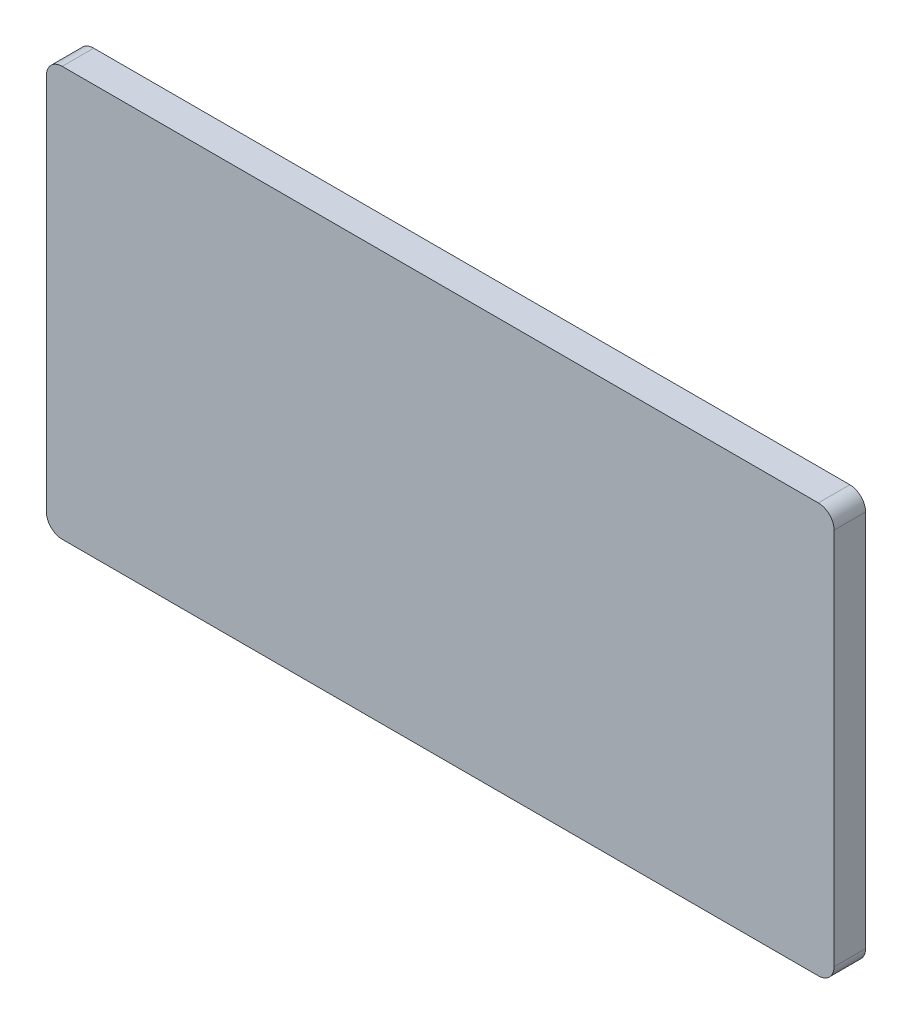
ISO-10303-21;
HEADER;
FILE_DESCRIPTION(('STEP AP214'),'2;1');
FILE_NAME('part.step','',(''),(''),'','','');
FILE_SCHEMA(('AUTOMOTIVE_DESIGN { 1 0 10303 214 1 1 1 1 }'));
ENDSEC;
DATA;
#1=APPLICATION_CONTEXT('core data for automotive mechanical design processes');
#2=APPLICATION_PROTOCOL_DEFINITION('international standard','automotive_design',2000,#1);
#3=PRODUCT_CONTEXT('',#1,'mechanical');
#4=PRODUCT('Part','Part','',(#3));
#5=PRODUCT_RELATED_PRODUCT_CATEGORY('part','',(#4));
#6=PRODUCT_DEFINITION_FORMATION('','',#4);
#7=PRODUCT_DEFINITION_CONTEXT('part definition',#1,'design');
#8=PRODUCT_DEFINITION('design','',#6,#7);
#9=PRODUCT_DEFINITION_SHAPE('','',#8);
#10=(LENGTH_UNIT() NAMED_UNIT(*) SI_UNIT(.MILLI.,.METRE.));
#11=(NAMED_UNIT(*) PLANE_ANGLE_UNIT() SI_UNIT($,.RADIAN.));
#12=(NAMED_UNIT(*) SI_UNIT($,.STERADIAN.) SOLID_ANGLE_UNIT());
#13=UNCERTAINTY_MEASURE_WITH_UNIT(LENGTH_MEASURE(1.E-05),#10,'distance_accuracy_value','');
#14=(GEOMETRIC_REPRESENTATION_CONTEXT(3) GLOBAL_UNCERTAINTY_ASSIGNED_CONTEXT((#13)) GLOBAL_UNIT_ASSIGNED_CONTEXT((#10,
#11,#12)) REPRESENTATION_CONTEXT('',''));
#15=CARTESIAN_POINT('',(0.,0.,0.));
#16=DIRECTION('',(0.,0.,1.));
#17=DIRECTION('',(1.,0.,0.));
#18=AXIS2_PLACEMENT_3D('',#15,#16,#17);
#19=CARTESIAN_POINT('',(-25.,13.,2.));
#20=DIRECTION('',(1.,0.,0.));
#21=DIRECTION('',(0.,1.,0.));
#22=AXIS2_PLACEMENT_3D('',#19,#20,#21);
#23=PLANE('',#22);
#24=DIRECTION('',(0.,-1.,0.));
#25=VECTOR('',#24,1.);
#26=CARTESIAN_POINT('',(-25.,13.,0.));
#27=LINE('',#26,#25);
#28=CARTESIAN_POINT('',(-25.,12.,0.));
#29=VERTEX_POINT('',#28);
#30=CARTESIAN_POINT('',(-25.,-12.,0.));
#31=VERTEX_POINT('',#30);
#32=EDGE_CURVE('E126',#29,#31,#27,.T.);
#33=ORIENTED_EDGE('',*,*,#32,.T.);
#34=DIRECTION('',(0.,0.,-1.));
#35=VECTOR('',#34,1.);
#36=CARTESIAN_POINT('',(-25.,-12.,2.));
#37=LINE('',#36,#35);
#38=CARTESIAN_POINT('',(-25.,-12.,2.));
#39=VERTEX_POINT('',#38);
#40=EDGE_CURVE('E11',#31,#39,#37,.F.);
#41=ORIENTED_EDGE('',*,*,#40,.T.);
#42=DIRECTION('',(0.,-1.,0.));
#43=VECTOR('',#42,1.);
#44=CARTESIAN_POINT('',(-25.,13.,2.));
#45=LINE('',#44,#43);
#46=CARTESIAN_POINT('',(-25.,12.,2.));
#47=VERTEX_POINT('',#46);
#48=EDGE_CURVE('E124',#47,#39,#45,.T.);
#49=ORIENTED_EDGE('',*,*,#48,.F.);
#50=DIRECTION('',(0.,0.,-1.));
#51=VECTOR('',#50,1.);
#52=CARTESIAN_POINT('',(-25.,12.,2.));
#53=LINE('',#52,#51);
#54=EDGE_CURVE('E38',#47,#29,#53,.T.);
#55=ORIENTED_EDGE('',*,*,#54,.T.);
#56=EDGE_LOOP('',(#33,#41,#49,#55));
#57=FACE_BOUND('',#56,.T.);
#58=ADVANCED_FACE('F31',(#57),#23,.F.);
#59=CARTESIAN_POINT('',(-25.,-13.,2.));
#60=DIRECTION('',(0.,1.,0.));
#61=DIRECTION('',(0.,0.,1.));
#62=AXIS2_PLACEMENT_3D('',#59,#60,#61);
#63=PLANE('',#62);
#64=DIRECTION('',(1.,0.,0.));
#65=VECTOR('',#64,1.);
#66=CARTESIAN_POINT('',(-25.,-13.,0.));
#67=LINE('',#66,#65);
#68=CARTESIAN_POINT('',(-24.,-13.,0.));
#69=VERTEX_POINT('',#68);
#70=CARTESIAN_POINT('',(24.,-13.,0.));
#71=VERTEX_POINT('',#70);
#72=EDGE_CURVE('E122',#69,#71,#67,.T.);
#73=ORIENTED_EDGE('',*,*,#72,.T.);
#74=DIRECTION('',(0.,0.,-1.));
#75=VECTOR('',#74,1.);
#76=CARTESIAN_POINT('',(24.,-13.,2.));
#77=LINE('',#76,#75);
#78=CARTESIAN_POINT('',(24.,-13.,2.));
#79=VERTEX_POINT('',#78);
#80=EDGE_CURVE('E101',#71,#79,#77,.F.);
#81=ORIENTED_EDGE('',*,*,#80,.T.);
#82=DIRECTION('',(1.,0.,0.));
#83=VECTOR('',#82,1.);
#84=CARTESIAN_POINT('',(-25.,-13.,2.));
#85=LINE('',#84,#83);
#86=CARTESIAN_POINT('',(-24.,-13.,2.));
#87=VERTEX_POINT('',#86);
#88=EDGE_CURVE('E132',#87,#79,#85,.T.);
#89=ORIENTED_EDGE('',*,*,#88,.F.);
#90=DIRECTION('',(0.,0.,-1.));
#91=VECTOR('',#90,1.);
#92=CARTESIAN_POINT('',(-24.,-13.,2.));
#93=LINE('',#92,#91);
#94=EDGE_CURVE('E106',#87,#69,#93,.T.);
#95=ORIENTED_EDGE('',*,*,#94,.T.);
#96=EDGE_LOOP('',(#73,#81,#89,#95));
#97=FACE_BOUND('',#96,.T.);
#98=ADVANCED_FACE('F171',(#97),#63,.F.);
#99=CARTESIAN_POINT('',(25.,13.,2.));
#100=DIRECTION('',(-1.,0.,0.));
#101=DIRECTION('',(0.,-1.,0.));
#102=AXIS2_PLACEMENT_3D('',#99,#100,#101);
#103=PLANE('',#102);
#104=DIRECTION('',(0.,1.,0.));
#105=VECTOR('',#104,1.);
#106=CARTESIAN_POINT('',(25.,13.,2.));
#107=LINE('',#106,#105);
#108=CARTESIAN_POINT('',(25.,-12.,2.));
#109=VERTEX_POINT('',#108);
#110=CARTESIAN_POINT('',(25.,12.,2.));
#111=VERTEX_POINT('',#110);
#112=EDGE_CURVE('E115',#109,#111,#107,.T.);
#113=ORIENTED_EDGE('',*,*,#112,.F.);
#114=DIRECTION('',(0.,0.,-1.));
#115=VECTOR('',#114,1.);
#116=CARTESIAN_POINT('',(25.,-12.,2.));
#117=LINE('',#116,#115);
#118=CARTESIAN_POINT('',(25.,-12.,0.));
#119=VERTEX_POINT('',#118);
#120=EDGE_CURVE('E100',#109,#119,#117,.T.);
#121=ORIENTED_EDGE('',*,*,#120,.T.);
#122=DIRECTION('',(0.,1.,0.));
#123=VECTOR('',#122,1.);
#124=CARTESIAN_POINT('',(25.,13.,0.));
#125=LINE('',#124,#123);
#126=CARTESIAN_POINT('',(25.,12.,0.));
#127=VERTEX_POINT('',#126);
#128=EDGE_CURVE('E113',#119,#127,#125,.T.);
#129=ORIENTED_EDGE('',*,*,#128,.T.);
#130=DIRECTION('',(0.,0.,-1.));
#131=VECTOR('',#130,1.);
#132=CARTESIAN_POINT('',(25.,12.,2.));
#133=LINE('',#132,#131);
#134=EDGE_CURVE('E117',#127,#111,#133,.F.);
#135=ORIENTED_EDGE('',*,*,#134,.T.);
#136=EDGE_LOOP('',(#113,#121,#129,#135));
#137=FACE_BOUND('',#136,.T.);
#138=ADVANCED_FACE('F112',(#137),#103,.F.);
#139=CARTESIAN_POINT('',(-25.,13.,2.));
#140=DIRECTION('',(0.,-1.,0.));
#141=DIRECTION('',(0.,0.,-1.));
#142=AXIS2_PLACEMENT_3D('',#139,#140,#141);
#143=PLANE('',#142);
#144=DIRECTION('',(-1.,0.,0.));
#145=VECTOR('',#144,1.);
#146=CARTESIAN_POINT('',(-25.,13.,2.));
#147=LINE('',#146,#145);
#148=CARTESIAN_POINT('',(24.,13.,2.));
#149=VERTEX_POINT('',#148);
#150=CARTESIAN_POINT('',(-24.,13.,2.));
#151=VERTEX_POINT('',#150);
#152=EDGE_CURVE('E136',#149,#151,#147,.T.);
#153=ORIENTED_EDGE('',*,*,#152,.F.);
#154=DIRECTION('',(0.,0.,-1.));
#155=VECTOR('',#154,1.);
#156=CARTESIAN_POINT('',(24.,13.,2.));
#157=LINE('',#156,#155);
#158=CARTESIAN_POINT('',(24.,13.,0.));
#159=VERTEX_POINT('',#158);
#160=EDGE_CURVE('E154',#149,#159,#157,.T.);
#161=ORIENTED_EDGE('',*,*,#160,.T.);
#162=DIRECTION('',(-1.,0.,0.));
#163=VECTOR('',#162,1.);
#164=CARTESIAN_POINT('',(-25.,13.,0.));
#165=LINE('',#164,#163);
#166=CARTESIAN_POINT('',(-24.,13.,0.));
#167=VERTEX_POINT('',#166);
#168=EDGE_CURVE('E121',#159,#167,#165,.T.);
#169=ORIENTED_EDGE('',*,*,#168,.T.);
#170=DIRECTION('',(0.,0.,-1.));
#171=VECTOR('',#170,1.);
#172=CARTESIAN_POINT('',(-24.,13.,2.));
#173=LINE('',#172,#171);
#174=EDGE_CURVE('E45',#167,#151,#173,.F.);
#175=ORIENTED_EDGE('',*,*,#174,.T.);
#176=EDGE_LOOP('',(#153,#161,#169,#175));
#177=FACE_BOUND('',#176,.T.);
#178=ADVANCED_FACE('F188',(#177),#143,.F.);
#179=CARTESIAN_POINT('',(-25.,-13.,2.));
#180=DIRECTION('',(0.,0.,1.));
#181=DIRECTION('',(1.,0.,0.));
#182=AXIS2_PLACEMENT_3D('',#179,#180,#181);
#183=PLANE('',#182);
#184=ORIENTED_EDGE('',*,*,#88,.T.);
#185=CARTESIAN_POINT('',(24.,-12.,2.));
#186=DIRECTION('',(0.,0.,1.));
#187=DIRECTION('',(1.,0.,0.));
#188=AXIS2_PLACEMENT_3D('',#185,#186,#187);
#189=CIRCLE('',#188,1.);
#190=EDGE_CURVE('E151',#79,#109,#189,.T.);
#191=ORIENTED_EDGE('',*,*,#190,.T.);
#192=ORIENTED_EDGE('',*,*,#112,.T.);
#193=CARTESIAN_POINT('',(24.,12.,2.));
#194=DIRECTION('',(0.,0.,1.));
#195=DIRECTION('',(1.,0.,0.));
#196=AXIS2_PLACEMENT_3D('',#193,#194,#195);
#197=CIRCLE('',#196,1.);
#198=EDGE_CURVE('E52',#111,#149,#197,.T.);
#199=ORIENTED_EDGE('',*,*,#198,.T.);
#200=ORIENTED_EDGE('',*,*,#152,.T.);
#201=CARTESIAN_POINT('',(-24.,12.,2.));
#202=DIRECTION('',(0.,0.,1.));
#203=DIRECTION('',(1.,0.,0.));
#204=AXIS2_PLACEMENT_3D('',#201,#202,#203);
#205=CIRCLE('',#204,1.);
#206=EDGE_CURVE('E146',#151,#47,#205,.T.);
#207=ORIENTED_EDGE('',*,*,#206,.T.);
#208=ORIENTED_EDGE('',*,*,#48,.T.);
#209=CARTESIAN_POINT('',(-24.,-12.,2.));
#210=DIRECTION('',(0.,0.,1.));
#211=DIRECTION('',(1.,0.,0.));
#212=AXIS2_PLACEMENT_3D('',#209,#210,#211);
#213=CIRCLE('',#212,1.);
#214=EDGE_CURVE('E148',#39,#87,#213,.T.);
#215=ORIENTED_EDGE('',*,*,#214,.T.);
#216=EDGE_LOOP('',(#184,#191,#192,#199,#200,#207,#208,#215));
#217=FACE_BOUND('',#216,.T.);
#218=ADVANCED_FACE('F172',(#217),#183,.T.);
#219=CARTESIAN_POINT('',(-25.,-13.,0.));
#220=DIRECTION('',(0.,0.,1.));
#221=DIRECTION('',(1.,0.,0.));
#222=AXIS2_PLACEMENT_3D('',#219,#220,#221);
#223=PLANE('',#222);
#224=ORIENTED_EDGE('',*,*,#128,.F.);
#225=CARTESIAN_POINT('',(24.,-12.,0.));
#226=DIRECTION('',(0.,0.,1.));
#227=DIRECTION('',(1.,0.,0.));
#228=AXIS2_PLACEMENT_3D('',#225,#226,#227);
#229=CIRCLE('',#228,1.);
#230=EDGE_CURVE('E96',#119,#71,#229,.F.);
#231=ORIENTED_EDGE('',*,*,#230,.T.);
#232=ORIENTED_EDGE('',*,*,#72,.F.);
#233=CARTESIAN_POINT('',(-24.,-12.,0.));
#234=DIRECTION('',(0.,0.,1.));
#235=DIRECTION('',(1.,0.,0.));
#236=AXIS2_PLACEMENT_3D('',#233,#234,#235);
#237=CIRCLE('',#236,1.);
#238=EDGE_CURVE('E140',#69,#31,#237,.F.);
#239=ORIENTED_EDGE('',*,*,#238,.T.);
#240=ORIENTED_EDGE('',*,*,#32,.F.);
#241=CARTESIAN_POINT('',(-24.,12.,0.));
#242=DIRECTION('',(0.,0.,1.));
#243=DIRECTION('',(1.,0.,0.));
#244=AXIS2_PLACEMENT_3D('',#241,#242,#243);
#245=CIRCLE('',#244,1.);
#246=EDGE_CURVE('E116',#29,#167,#245,.F.);
#247=ORIENTED_EDGE('',*,*,#246,.T.);
#248=ORIENTED_EDGE('',*,*,#168,.F.);
#249=CARTESIAN_POINT('',(24.,12.,0.));
#250=DIRECTION('',(0.,0.,1.));
#251=DIRECTION('',(1.,0.,0.));
#252=AXIS2_PLACEMENT_3D('',#249,#250,#251);
#253=CIRCLE('',#252,1.);
#254=EDGE_CURVE('E107',#159,#127,#253,.F.);
#255=ORIENTED_EDGE('',*,*,#254,.T.);
#256=EDGE_LOOP('',(#224,#231,#232,#239,#240,#247,#248,#255));
#257=FACE_BOUND('',#256,.T.);
#258=ADVANCED_FACE('F119',(#257),#223,.F.);
#259=CARTESIAN_POINT('',(24.,-12.,2.));
#260=DIRECTION('',(0.,0.,-1.));
#261=DIRECTION('',(-1.,0.,0.));
#262=AXIS2_PLACEMENT_3D('',#259,#260,#261);
#263=CYLINDRICAL_SURFACE('',#262,1.);
#264=ORIENTED_EDGE('',*,*,#190,.F.);
#265=ORIENTED_EDGE('',*,*,#80,.F.);
#266=ORIENTED_EDGE('',*,*,#230,.F.);
#267=ORIENTED_EDGE('',*,*,#120,.F.);
#268=EDGE_LOOP('',(#264,#265,#266,#267));
#269=FACE_BOUND('',#268,.T.);
#270=ADVANCED_FACE('F99',(#269),#263,.T.);
#271=CARTESIAN_POINT('',(24.,12.,2.));
#272=DIRECTION('',(0.,0.,-1.));
#273=DIRECTION('',(-1.,0.,0.));
#274=AXIS2_PLACEMENT_3D('',#271,#272,#273);
#275=CYLINDRICAL_SURFACE('',#274,1.);
#276=ORIENTED_EDGE('',*,*,#198,.F.);
#277=ORIENTED_EDGE('',*,*,#134,.F.);
#278=ORIENTED_EDGE('',*,*,#254,.F.);
#279=ORIENTED_EDGE('',*,*,#160,.F.);
#280=EDGE_LOOP('',(#276,#277,#278,#279));
#281=FACE_BOUND('',#280,.T.);
#282=ADVANCED_FACE('F179',(#281),#275,.T.);
#283=CARTESIAN_POINT('',(-24.,-12.,2.));
#284=DIRECTION('',(0.,0.,-1.));
#285=DIRECTION('',(-1.,0.,0.));
#286=AXIS2_PLACEMENT_3D('',#283,#284,#285);
#287=CYLINDRICAL_SURFACE('',#286,1.);
#288=ORIENTED_EDGE('',*,*,#214,.F.);
#289=ORIENTED_EDGE('',*,*,#40,.F.);
#290=ORIENTED_EDGE('',*,*,#238,.F.);
#291=ORIENTED_EDGE('',*,*,#94,.F.);
#292=EDGE_LOOP('',(#288,#289,#290,#291));
#293=FACE_BOUND('',#292,.T.);
#294=ADVANCED_FACE('F168',(#293),#287,.T.);
#295=CARTESIAN_POINT('',(-24.,12.,2.));
#296=DIRECTION('',(0.,0.,-1.));
#297=DIRECTION('',(-1.,0.,0.));
#298=AXIS2_PLACEMENT_3D('',#295,#296,#297);
#299=CYLINDRICAL_SURFACE('',#298,1.);
#300=ORIENTED_EDGE('',*,*,#206,.F.);
#301=ORIENTED_EDGE('',*,*,#174,.F.);
#302=ORIENTED_EDGE('',*,*,#246,.F.);
#303=ORIENTED_EDGE('',*,*,#54,.F.);
#304=EDGE_LOOP('',(#300,#301,#302,#303));
#305=FACE_BOUND('',#304,.T.);
#306=ADVANCED_FACE('F173',(#305),#299,.T.);
#307=CLOSED_SHELL('',(#58,#98,#138,#178,#218,#258,#270,#282,#294,#306));
#308=MANIFOLD_SOLID_BREP('B2',#307);
#309=ADVANCED_BREP_SHAPE_REPRESENTATION('',(#18,#308),#14);
#310=SHAPE_DEFINITION_REPRESENTATION(#9,#309);
ENDSEC;
END-ISO-10303-21;
